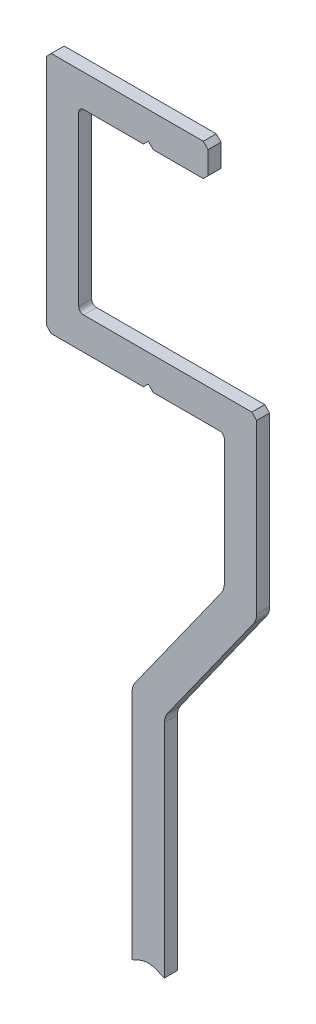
ISO-10303-21;
HEADER;
FILE_DESCRIPTION(('STEP AP214'),'2;1');
FILE_NAME('part.step','',(''),(''),'','','');
FILE_SCHEMA(('AUTOMOTIVE_DESIGN { 1 0 10303 214 1 1 1 1 }'));
ENDSEC;
DATA;
#1=APPLICATION_CONTEXT('core data for automotive mechanical design processes');
#2=APPLICATION_PROTOCOL_DEFINITION('international standard','automotive_design',2000,#1);
#3=PRODUCT_CONTEXT('',#1,'mechanical');
#4=PRODUCT('Part','Part','',(#3));
#5=PRODUCT_RELATED_PRODUCT_CATEGORY('part','',(#4));
#6=PRODUCT_DEFINITION_FORMATION('','',#4);
#7=PRODUCT_DEFINITION_CONTEXT('part definition',#1,'design');
#8=PRODUCT_DEFINITION('design','',#6,#7);
#9=PRODUCT_DEFINITION_SHAPE('','',#8);
#10=(LENGTH_UNIT() NAMED_UNIT(*) SI_UNIT(.MILLI.,.METRE.));
#11=(NAMED_UNIT(*) PLANE_ANGLE_UNIT() SI_UNIT($,.RADIAN.));
#12=(NAMED_UNIT(*) SI_UNIT($,.STERADIAN.) SOLID_ANGLE_UNIT());
#13=UNCERTAINTY_MEASURE_WITH_UNIT(LENGTH_MEASURE(1.E-05),#10,'distance_accuracy_value','');
#14=(GEOMETRIC_REPRESENTATION_CONTEXT(3) GLOBAL_UNCERTAINTY_ASSIGNED_CONTEXT((#13)) GLOBAL_UNIT_ASSIGNED_CONTEXT((#10,
#11,#12)) REPRESENTATION_CONTEXT('',''));
#15=CARTESIAN_POINT('',(0.,0.,0.));
#16=DIRECTION('',(0.,0.,1.));
#17=DIRECTION('',(1.,0.,0.));
#18=AXIS2_PLACEMENT_3D('',#15,#16,#17);
#19=CARTESIAN_POINT('',(0.,0.,0.));
#20=DIRECTION('',(0.,-1.,0.));
#21=DIRECTION('',(0.,0.,-1.));
#22=AXIS2_PLACEMENT_3D('',#19,#20,#21);
#23=PLANE('',#22);
#24=DIRECTION('',(0.,0.,1.));
#25=VECTOR('',#24,1.);
#26=CARTESIAN_POINT('',(53.,0.,8.));
#27=LINE('',#26,#25);
#28=CARTESIAN_POINT('',(53.,0.,8.));
#29=VERTEX_POINT('',#28);
#30=CARTESIAN_POINT('',(53.,0.,0.));
#31=VERTEX_POINT('',#30);
#32=EDGE_CURVE('E287',#29,#31,#27,.F.);
#33=ORIENTED_EDGE('',*,*,#32,.T.);
#34=DIRECTION('',(1.,0.,0.));
#35=VECTOR('',#34,1.);
#36=CARTESIAN_POINT('',(65.,0.,0.));
#37=LINE('',#36,#35);
#38=CARTESIAN_POINT('',(53.6844486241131,0.,0.));
#39=VERTEX_POINT('',#38);
#40=EDGE_CURVE('E190',#31,#39,#37,.T.);
#41=ORIENTED_EDGE('',*,*,#40,.T.);
#42=DIRECTION('',(0.,0.,1.));
#43=VECTOR('',#42,1.);
#44=CARTESIAN_POINT('',(53.6844486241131,0.,8.));
#45=LINE('',#44,#43);
#46=CARTESIAN_POINT('',(53.6844486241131,0.,8.));
#47=VERTEX_POINT('',#46);
#48=EDGE_CURVE('E188',#39,#47,#45,.T.);
#49=ORIENTED_EDGE('',*,*,#48,.T.);
#50=DIRECTION('',(1.,0.,0.));
#51=VECTOR('',#50,1.);
#52=CARTESIAN_POINT('',(0.,0.,8.));
#53=LINE('',#52,#51);
#54=EDGE_CURVE('E173',#47,#29,#53,.F.);
#55=ORIENTED_EDGE('',*,*,#54,.T.);
#56=EDGE_LOOP('',(#33,#41,#49,#55));
#57=FACE_BOUND('',#56,.T.);
#58=ADVANCED_FACE('F17',(#57),#23,.T.);
#59=CARTESIAN_POINT('',(0.,0.,0.));
#60=DIRECTION('',(0.,-1.,0.));
#61=DIRECTION('',(0.,0.,-1.));
#62=AXIS2_PLACEMENT_3D('',#59,#60,#61);
#63=PLANE('',#62);
#64=DIRECTION('',(0.,0.,1.));
#65=VECTOR('',#64,1.);
#66=CARTESIAN_POINT('',(73.,0.,8.));
#67=LINE('',#66,#65);
#68=CARTESIAN_POINT('',(73.,0.,0.));
#69=VERTEX_POINT('',#68);
#70=CARTESIAN_POINT('',(73.,0.,8.));
#71=VERTEX_POINT('',#70);
#72=EDGE_CURVE('E267',#69,#71,#67,.T.);
#73=ORIENTED_EDGE('',*,*,#72,.T.);
#74=DIRECTION('',(1.,0.,0.));
#75=VECTOR('',#74,1.);
#76=CARTESIAN_POINT('',(0.,0.,8.));
#77=LINE('',#76,#75);
#78=CARTESIAN_POINT('',(72.3155513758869,0.,8.));
#79=VERTEX_POINT('',#78);
#80=EDGE_CURVE('E185',#71,#79,#77,.F.);
#81=ORIENTED_EDGE('',*,*,#80,.T.);
#82=DIRECTION('',(0.,0.,1.));
#83=VECTOR('',#82,1.);
#84=CARTESIAN_POINT('',(72.3155513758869,0.,8.));
#85=LINE('',#84,#83);
#86=CARTESIAN_POINT('',(72.3155513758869,0.,0.));
#87=VERTEX_POINT('',#86);
#88=EDGE_CURVE('E275',#79,#87,#85,.F.);
#89=ORIENTED_EDGE('',*,*,#88,.T.);
#90=DIRECTION('',(1.,0.,0.));
#91=VECTOR('',#90,1.);
#92=CARTESIAN_POINT('',(65.,0.,0.));
#93=LINE('',#92,#91);
#94=EDGE_CURVE('E475',#87,#69,#93,.T.);
#95=ORIENTED_EDGE('',*,*,#94,.T.);
#96=EDGE_LOOP('',(#73,#81,#89,#95));
#97=FACE_BOUND('',#96,.T.);
#98=ADVANCED_FACE('F1085',(#97),#63,.T.);
#99=CARTESIAN_POINT('',(65.,230.,0.));
#100=DIRECTION('',(0.,0.,1.));
#101=DIRECTION('',(1.,0.,0.));
#102=AXIS2_PLACEMENT_3D('',#99,#100,#101);
#103=PLANE('',#102);
#104=DIRECTION('',(0.,1.,0.));
#105=VECTOR('',#104,1.);
#106=CARTESIAN_POINT('',(130.,0.,0.));
#107=LINE('',#106,#105);
#108=CARTESIAN_POINT('',(130.,223.198126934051,0.));
#109=VERTEX_POINT('',#108);
#110=CARTESIAN_POINT('',(130.,327.,0.));
#111=VERTEX_POINT('',#110);
#112=EDGE_CURVE('E247',#109,#111,#107,.T.);
#113=ORIENTED_EDGE('',*,*,#112,.F.);
#114=CARTESIAN_POINT('',(120.,223.198126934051,0.));
#115=DIRECTION('',(0.,0.,-1.));
#116=DIRECTION('',(-1.,0.,0.));
#117=AXIS2_PLACEMENT_3D('',#114,#115,#116);
#118=CIRCLE('',#117,10.);
#119=CARTESIAN_POINT('',(128.144207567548,217.395379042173,0.));
#120=VERTEX_POINT('',#119);
#121=EDGE_CURVE('E260',#120,#109,#118,.F.);
#122=ORIENTED_EDGE('',*,*,#121,.F.);
#123=DIRECTION('',(-0.580274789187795,-0.8144207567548,0.));
#124=VECTOR('',#123,1.);
#125=CARTESIAN_POINT('',(73.,140.,0.));
#126=LINE('',#125,#124);
#127=CARTESIAN_POINT('',(74.8557924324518,142.604620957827,0.));
#128=VERTEX_POINT('',#127);
#129=EDGE_CURVE('E263',#120,#128,#126,.T.);
#130=ORIENTED_EDGE('',*,*,#129,.T.);
#131=CARTESIAN_POINT('',(83.,136.801873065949,0.));
#132=DIRECTION('',(0.,0.,-1.));
#133=DIRECTION('',(-1.,0.,0.));
#134=AXIS2_PLACEMENT_3D('',#131,#132,#133);
#135=CIRCLE('',#134,10.);
#136=CARTESIAN_POINT('',(73.,136.801873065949,0.));
#137=VERTEX_POINT('',#136);
#138=EDGE_CURVE('E266',#128,#137,#135,.F.);
#139=ORIENTED_EDGE('',*,*,#138,.T.);
#140=DIRECTION('',(0.,-1.,0.));
#141=VECTOR('',#140,1.);
#142=CARTESIAN_POINT('',(73.,0.,0.));
#143=LINE('',#142,#141);
#144=EDGE_CURVE('E270',#137,#69,#143,.T.);
#145=ORIENTED_EDGE('',*,*,#144,.T.);
#146=ORIENTED_EDGE('',*,*,#94,.F.);
#147=DIRECTION('',(-0.90630778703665,0.4226182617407,0.));
#148=VECTOR('',#147,1.);
#149=CARTESIAN_POINT('',(68.4940374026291,1.78200123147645,0.));
#150=LINE('',#149,#148);
#151=CARTESIAN_POINT('',(68.4940374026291,1.78200123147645,0.));
#152=VERTEX_POINT('',#151);
#153=EDGE_CURVE('E276',#87,#152,#150,.T.);
#154=ORIENTED_EDGE('',*,*,#153,.T.);
#155=CARTESIAN_POINT('',(63.,-10.,0.));
#156=DIRECTION('',(0.,0.,-1.));
#157=DIRECTION('',(-1.,0.,0.));
#158=AXIS2_PLACEMENT_3D('',#155,#156,#157);
#159=CIRCLE('',#158,13.);
#160=CARTESIAN_POINT('',(57.5059625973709,1.78200123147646,0.));
#161=VERTEX_POINT('',#160);
#162=EDGE_CURVE('E194',#152,#161,#159,.F.);
#163=ORIENTED_EDGE('',*,*,#162,.T.);
#164=DIRECTION('',(-0.90630778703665,-0.4226182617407,0.));
#165=VECTOR('',#164,1.);
#166=CARTESIAN_POINT('',(23.0475966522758,-14.2861986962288,0.));
#167=LINE('',#166,#165);
#168=EDGE_CURVE('E195',#161,#39,#167,.T.);
#169=ORIENTED_EDGE('',*,*,#168,.T.);
#170=ORIENTED_EDGE('',*,*,#40,.F.);
#171=DIRECTION('',(0.,1.,0.));
#172=VECTOR('',#171,1.);
#173=CARTESIAN_POINT('',(53.,146.4,0.));
#174=LINE('',#173,#172);
#175=CARTESIAN_POINT('',(53.,143.201873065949,0.));
#176=VERTEX_POINT('',#175);
#177=EDGE_CURVE('E286',#31,#176,#174,.T.);
#178=ORIENTED_EDGE('',*,*,#177,.T.);
#179=CARTESIAN_POINT('',(63.,143.201873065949,0.));
#180=DIRECTION('',(0.,0.,-1.));
#181=DIRECTION('',(-1.,0.,0.));
#182=AXIS2_PLACEMENT_3D('',#179,#180,#181);
#183=CIRCLE('',#182,10.);
#184=CARTESIAN_POINT('',(54.8557924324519,149.004620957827,0.));
#185=VERTEX_POINT('',#184);
#186=EDGE_CURVE('E294',#185,#176,#183,.F.);
#187=ORIENTED_EDGE('',*,*,#186,.F.);
#188=DIRECTION('',(0.580274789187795,0.8144207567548,0.));
#189=VECTOR('',#188,1.);
#190=CARTESIAN_POINT('',(110.,226.4,0.));
#191=LINE('',#190,#189);
#192=CARTESIAN_POINT('',(108.144207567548,223.795379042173,0.));
#193=VERTEX_POINT('',#192);
#194=EDGE_CURVE('E297',#185,#193,#191,.T.);
#195=ORIENTED_EDGE('',*,*,#194,.T.);
#196=CARTESIAN_POINT('',(100.,229.598126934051,0.));
#197=DIRECTION('',(0.,0.,-1.));
#198=DIRECTION('',(-1.,0.,0.));
#199=AXIS2_PLACEMENT_3D('',#196,#197,#198);
#200=CIRCLE('',#199,10.);
#201=CARTESIAN_POINT('',(110.,229.598126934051,0.));
#202=VERTEX_POINT('',#201);
#203=EDGE_CURVE('E300',#193,#202,#200,.F.);
#204=ORIENTED_EDGE('',*,*,#203,.T.);
#205=DIRECTION('',(0.,1.,0.));
#206=VECTOR('',#205,1.);
#207=CARTESIAN_POINT('',(110.,310.,0.));
#208=LINE('',#207,#206);
#209=CARTESIAN_POINT('',(110.,307.,0.));
#210=VERTEX_POINT('',#209);
#211=EDGE_CURVE('E303',#202,#210,#208,.T.);
#212=ORIENTED_EDGE('',*,*,#211,.T.);
#213=CARTESIAN_POINT('',(107.,307.,0.));
#214=DIRECTION('',(0.,0.,-1.));
#215=DIRECTION('',(-1.,0.,0.));
#216=AXIS2_PLACEMENT_3D('',#213,#214,#215);
#217=CIRCLE('',#216,3.);
#218=CARTESIAN_POINT('',(107.,310.,0.));
#219=VERTEX_POINT('',#218);
#220=EDGE_CURVE('E306',#210,#219,#217,.F.);
#221=ORIENTED_EDGE('',*,*,#220,.T.);
#222=DIRECTION('',(1.,0.,0.));
#223=VECTOR('',#222,1.);
#224=CARTESIAN_POINT('',(0.,310.,0.));
#225=LINE('',#224,#223);
#226=CARTESIAN_POINT('',(66.,310.,0.));
#227=VERTEX_POINT('',#226);
#228=EDGE_CURVE('E310',#219,#227,#225,.F.);
#229=ORIENTED_EDGE('',*,*,#228,.T.);
#230=DIRECTION('',(-0.707106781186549,0.707106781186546,0.));
#231=VECTOR('',#230,1.);
#232=CARTESIAN_POINT('',(63.,313.,0.));
#233=LINE('',#232,#231);
#234=CARTESIAN_POINT('',(62.9999999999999,313.,0.));
#235=VERTEX_POINT('',#234);
#236=EDGE_CURVE('E321',#227,#235,#233,.T.);
#237=ORIENTED_EDGE('',*,*,#236,.T.);
#238=DIRECTION('',(-0.70710678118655,-0.707106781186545,0.));
#239=VECTOR('',#238,1.);
#240=CARTESIAN_POINT('',(55.9289321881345,305.928932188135,0.));
#241=LINE('',#240,#239);
#242=CARTESIAN_POINT('',(59.9999999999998,310.,0.));
#243=VERTEX_POINT('',#242);
#244=EDGE_CURVE('E332',#235,#243,#241,.T.);
#245=ORIENTED_EDGE('',*,*,#244,.T.);
#246=DIRECTION('',(1.,0.,0.));
#247=VECTOR('',#246,1.);
#248=CARTESIAN_POINT('',(0.,310.,0.));
#249=LINE('',#248,#247);
#250=CARTESIAN_POINT('',(3.,310.,0.));
#251=VERTEX_POINT('',#250);
#252=EDGE_CURVE('E343',#243,#251,#249,.F.);
#253=ORIENTED_EDGE('',*,*,#252,.T.);
#254=DIRECTION('',(0.707106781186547,-0.707106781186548,0.));
#255=VECTOR('',#254,1.);
#256=CARTESIAN_POINT('',(1.5,311.5,0.));
#257=LINE('',#256,#255);
#258=CARTESIAN_POINT('',(0.,313.,0.));
#259=VERTEX_POINT('',#258);
#260=EDGE_CURVE('E354',#259,#251,#257,.T.);
#261=ORIENTED_EDGE('',*,*,#260,.F.);
#262=DIRECTION('',(0.,1.,0.));
#263=VECTOR('',#262,1.);
#264=CARTESIAN_POINT('',(0.,460.,0.));
#265=LINE('',#264,#263);
#266=CARTESIAN_POINT('',(0.,457.,0.));
#267=VERTEX_POINT('',#266);
#268=EDGE_CURVE('E355',#267,#259,#265,.F.);
#269=ORIENTED_EDGE('',*,*,#268,.F.);
#270=DIRECTION('',(-0.707106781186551,-0.707106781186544,0.));
#271=VECTOR('',#270,1.);
#272=CARTESIAN_POINT('',(1.5,458.5,0.));
#273=LINE('',#272,#271);
#274=CARTESIAN_POINT('',(3.00000000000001,460.,0.));
#275=VERTEX_POINT('',#274);
#276=EDGE_CURVE('E366',#275,#267,#273,.T.);
#277=ORIENTED_EDGE('',*,*,#276,.F.);
#278=DIRECTION('',(1.,0.,0.));
#279=VECTOR('',#278,1.);
#280=CARTESIAN_POINT('',(130.,460.,0.));
#281=LINE('',#280,#279);
#282=CARTESIAN_POINT('',(97.,460.,0.));
#283=VERTEX_POINT('',#282);
#284=EDGE_CURVE('E377',#283,#275,#281,.F.);
#285=ORIENTED_EDGE('',*,*,#284,.F.);
#286=DIRECTION('',(-0.707106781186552,0.707106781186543,0.));
#287=VECTOR('',#286,1.);
#288=CARTESIAN_POINT('',(98.5,458.5,0.));
#289=LINE('',#288,#287);
#290=CARTESIAN_POINT('',(100.,457.,0.));
#291=VERTEX_POINT('',#290);
#292=EDGE_CURVE('E398',#291,#283,#289,.T.);
#293=ORIENTED_EDGE('',*,*,#292,.F.);
#294=DIRECTION('',(0.,1.,0.));
#295=VECTOR('',#294,1.);
#296=CARTESIAN_POINT('',(100.,440.,0.));
#297=LINE('',#296,#295);
#298=CARTESIAN_POINT('',(100.,443.,0.));
#299=VERTEX_POINT('',#298);
#300=EDGE_CURVE('E409',#291,#299,#297,.F.);
#301=ORIENTED_EDGE('',*,*,#300,.T.);
#302=DIRECTION('',(0.707106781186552,0.707106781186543,0.));
#303=VECTOR('',#302,1.);
#304=CARTESIAN_POINT('',(98.5,441.5,0.));
#305=LINE('',#304,#303);
#306=CARTESIAN_POINT('',(97.,440.,0.));
#307=VERTEX_POINT('',#306);
#308=EDGE_CURVE('E420',#307,#299,#305,.T.);
#309=ORIENTED_EDGE('',*,*,#308,.F.);
#310=DIRECTION('',(1.,0.,0.));
#311=VECTOR('',#310,1.);
#312=CARTESIAN_POINT('',(20.,440.,0.));
#313=LINE('',#312,#311);
#314=CARTESIAN_POINT('',(66.,440.,0.));
#315=VERTEX_POINT('',#314);
#316=EDGE_CURVE('E431',#307,#315,#313,.F.);
#317=ORIENTED_EDGE('',*,*,#316,.T.);
#318=DIRECTION('',(-0.707106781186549,0.707106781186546,0.));
#319=VECTOR('',#318,1.);
#320=CARTESIAN_POINT('',(63.0000000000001,443.,0.));
#321=LINE('',#320,#319);
#322=CARTESIAN_POINT('',(63.,443.,0.));
#323=VERTEX_POINT('',#322);
#324=EDGE_CURVE('E441',#315,#323,#321,.T.);
#325=ORIENTED_EDGE('',*,*,#324,.T.);
#326=DIRECTION('',(-0.70710678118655,-0.707106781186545,0.));
#327=VECTOR('',#326,1.);
#328=CARTESIAN_POINT('',(55.9289321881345,435.928932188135,0.));
#329=LINE('',#328,#327);
#330=CARTESIAN_POINT('',(59.9999999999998,440.,0.));
#331=VERTEX_POINT('',#330);
#332=EDGE_CURVE('E451',#323,#331,#329,.T.);
#333=ORIENTED_EDGE('',*,*,#332,.T.);
#334=DIRECTION('',(1.,0.,0.));
#335=VECTOR('',#334,1.);
#336=CARTESIAN_POINT('',(20.,440.,0.));
#337=LINE('',#336,#335);
#338=CARTESIAN_POINT('',(23.,440.,0.));
#339=VERTEX_POINT('',#338);
#340=EDGE_CURVE('E456',#331,#339,#337,.F.);
#341=ORIENTED_EDGE('',*,*,#340,.T.);
#342=CARTESIAN_POINT('',(23.,437.,0.));
#343=DIRECTION('',(0.,0.,-1.));
#344=DIRECTION('',(-1.,0.,0.));
#345=AXIS2_PLACEMENT_3D('',#342,#343,#344);
#346=CIRCLE('',#345,3.);
#347=CARTESIAN_POINT('',(20.,437.,0.));
#348=VERTEX_POINT('',#347);
#349=EDGE_CURVE('E459',#339,#348,#346,.F.);
#350=ORIENTED_EDGE('',*,*,#349,.T.);
#351=DIRECTION('',(0.,-1.,0.));
#352=VECTOR('',#351,1.);
#353=CARTESIAN_POINT('',(20.,330.,0.));
#354=LINE('',#353,#352);
#355=CARTESIAN_POINT('',(20.,333.,0.));
#356=VERTEX_POINT('',#355);
#357=EDGE_CURVE('E143',#348,#356,#354,.T.);
#358=ORIENTED_EDGE('',*,*,#357,.T.);
#359=CARTESIAN_POINT('',(23.,333.,0.));
#360=DIRECTION('',(0.,0.,-1.));
#361=DIRECTION('',(-1.,0.,0.));
#362=AXIS2_PLACEMENT_3D('',#359,#360,#361);
#363=CIRCLE('',#362,3.);
#364=CARTESIAN_POINT('',(23.,330.,0.));
#365=VERTEX_POINT('',#364);
#366=EDGE_CURVE('E20',#356,#365,#363,.F.);
#367=ORIENTED_EDGE('',*,*,#366,.T.);
#368=DIRECTION('',(1.,0.,0.));
#369=VECTOR('',#368,1.);
#370=CARTESIAN_POINT('',(130.,330.,0.));
#371=LINE('',#370,#369);
#372=CARTESIAN_POINT('',(127.,330.,0.));
#373=VERTEX_POINT('',#372);
#374=EDGE_CURVE('E150',#365,#373,#371,.T.);
#375=ORIENTED_EDGE('',*,*,#374,.T.);
#376=DIRECTION('',(-0.707106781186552,0.707106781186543,0.));
#377=VECTOR('',#376,1.);
#378=CARTESIAN_POINT('',(128.5,328.5,0.));
#379=LINE('',#378,#377);
#380=EDGE_CURVE('E473',#111,#373,#379,.T.);
#381=ORIENTED_EDGE('',*,*,#380,.F.);
#382=EDGE_LOOP('',(#113,#122,#130,#139,#145,#146,#154,#163,#169,#170,#178,#187,#195,#204,#212,
#221,#229,#237,#245,#253,#261,#269,#277,#285,#293,#301,#309,#317,#325,#333,#341,#350,#358,#367,
#375,#381));
#383=FACE_BOUND('',#382,.T.);
#384=ADVANCED_FACE('F591',(#383),#103,.F.);
#385=CARTESIAN_POINT('',(128.5,328.5,4.));
#386=DIRECTION('',(0.707106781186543,0.707106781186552,0.));
#387=DIRECTION('',(-0.707106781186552,0.707106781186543,0.));
#388=AXIS2_PLACEMENT_3D('',#385,#386,#387);
#389=PLANE('',#388);
#390=ORIENTED_EDGE('',*,*,#380,.T.);
#391=DIRECTION('',(0.,0.,-1.));
#392=VECTOR('',#391,1.);
#393=CARTESIAN_POINT('',(127.,330.,8.));
#394=LINE('',#393,#392);
#395=CARTESIAN_POINT('',(127.,330.,8.));
#396=VERTEX_POINT('',#395);
#397=EDGE_CURVE('E464',#373,#396,#394,.F.);
#398=ORIENTED_EDGE('',*,*,#397,.T.);
#399=DIRECTION('',(-0.707106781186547,0.707106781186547,0.));
#400=VECTOR('',#399,1.);
#401=CARTESIAN_POINT('',(130.,327.,8.));
#402=LINE('',#401,#400);
#403=CARTESIAN_POINT('',(130.,327.,8.));
#404=VERTEX_POINT('',#403);
#405=EDGE_CURVE('E243',#404,#396,#402,.T.);
#406=ORIENTED_EDGE('',*,*,#405,.F.);
#407=DIRECTION('',(0.,0.,-1.));
#408=VECTOR('',#407,1.);
#409=CARTESIAN_POINT('',(130.,327.,0.));
#410=LINE('',#409,#408);
#411=EDGE_CURVE('E248',#111,#404,#410,.F.);
#412=ORIENTED_EDGE('',*,*,#411,.F.);
#413=EDGE_LOOP('',(#390,#398,#406,#412));
#414=FACE_BOUND('',#413,.T.);
#415=ADVANCED_FACE('F613',(#414),#389,.T.);
#416=CARTESIAN_POINT('',(130.,330.,8.));
#417=DIRECTION('',(0.,-1.,0.));
#418=DIRECTION('',(0.,0.,-1.));
#419=AXIS2_PLACEMENT_3D('',#416,#417,#418);
#420=PLANE('',#419);
#421=ORIENTED_EDGE('',*,*,#374,.F.);
#422=DIRECTION('',(0.,0.,-1.));
#423=VECTOR('',#422,1.);
#424=CARTESIAN_POINT('',(23.,330.,8.));
#425=LINE('',#424,#423);
#426=CARTESIAN_POINT('',(23.,330.,8.));
#427=VERTEX_POINT('',#426);
#428=EDGE_CURVE('E462',#365,#427,#425,.F.);
#429=ORIENTED_EDGE('',*,*,#428,.T.);
#430=DIRECTION('',(1.,0.,0.));
#431=VECTOR('',#430,1.);
#432=CARTESIAN_POINT('',(65.,330.,8.));
#433=LINE('',#432,#431);
#434=EDGE_CURVE('E240',#396,#427,#433,.F.);
#435=ORIENTED_EDGE('',*,*,#434,.F.);
#436=ORIENTED_EDGE('',*,*,#397,.F.);
#437=EDGE_LOOP('',(#421,#429,#435,#436));
#438=FACE_BOUND('',#437,.T.);
#439=ADVANCED_FACE('F609',(#438),#420,.F.);
#440=CARTESIAN_POINT('',(23.,333.,8.));
#441=DIRECTION('',(0.,0.,-1.));
#442=DIRECTION('',(-1.,0.,0.));
#443=AXIS2_PLACEMENT_3D('',#440,#441,#442);
#444=CYLINDRICAL_SURFACE('',#443,3.);
#445=ORIENTED_EDGE('',*,*,#428,.F.);
#446=ORIENTED_EDGE('',*,*,#366,.F.);
#447=DIRECTION('',(0.,0.,1.));
#448=VECTOR('',#447,1.);
#449=CARTESIAN_POINT('',(20.,333.,8.));
#450=LINE('',#449,#448);
#451=CARTESIAN_POINT('',(20.,333.,8.));
#452=VERTEX_POINT('',#451);
#453=EDGE_CURVE('E460',#356,#452,#450,.T.);
#454=ORIENTED_EDGE('',*,*,#453,.T.);
#455=CARTESIAN_POINT('',(23.,333.,8.));
#456=DIRECTION('',(0.,0.,-1.));
#457=DIRECTION('',(-1.,0.,0.));
#458=AXIS2_PLACEMENT_3D('',#455,#456,#457);
#459=CIRCLE('',#458,3.);
#460=EDGE_CURVE('E239',#427,#452,#459,.T.);
#461=ORIENTED_EDGE('',*,*,#460,.F.);
#462=EDGE_LOOP('',(#445,#446,#454,#461));
#463=FACE_BOUND('',#462,.T.);
#464=ADVANCED_FACE('F607',(#463),#444,.F.);
#465=CARTESIAN_POINT('',(20.,330.,8.));
#466=DIRECTION('',(-1.,0.,0.));
#467=DIRECTION('',(0.,-1.,0.));
#468=AXIS2_PLACEMENT_3D('',#465,#466,#467);
#469=PLANE('',#468);
#470=ORIENTED_EDGE('',*,*,#357,.F.);
#471=DIRECTION('',(0.,0.,-1.));
#472=VECTOR('',#471,1.);
#473=CARTESIAN_POINT('',(20.,437.,8.));
#474=LINE('',#473,#472);
#475=CARTESIAN_POINT('',(20.,437.,8.));
#476=VERTEX_POINT('',#475);
#477=EDGE_CURVE('E457',#348,#476,#474,.F.);
#478=ORIENTED_EDGE('',*,*,#477,.T.);
#479=DIRECTION('',(0.,1.,0.));
#480=VECTOR('',#479,1.);
#481=CARTESIAN_POINT('',(20.,230.,8.));
#482=LINE('',#481,#480);
#483=EDGE_CURVE('E236',#452,#476,#482,.T.);
#484=ORIENTED_EDGE('',*,*,#483,.F.);
#485=ORIENTED_EDGE('',*,*,#453,.F.);
#486=EDGE_LOOP('',(#470,#478,#484,#485));
#487=FACE_BOUND('',#486,.T.);
#488=ADVANCED_FACE('F598',(#487),#469,.F.);
#489=CARTESIAN_POINT('',(23.,437.,8.));
#490=DIRECTION('',(0.,0.,-1.));
#491=DIRECTION('',(-1.,0.,0.));
#492=AXIS2_PLACEMENT_3D('',#489,#490,#491);
#493=CYLINDRICAL_SURFACE('',#492,3.);
#494=ORIENTED_EDGE('',*,*,#477,.F.);
#495=ORIENTED_EDGE('',*,*,#349,.F.);
#496=DIRECTION('',(0.,0.,1.));
#497=VECTOR('',#496,1.);
#498=CARTESIAN_POINT('',(23.,440.,8.));
#499=LINE('',#498,#497);
#500=CARTESIAN_POINT('',(23.,440.,8.));
#501=VERTEX_POINT('',#500);
#502=EDGE_CURVE('E454',#339,#501,#499,.T.);
#503=ORIENTED_EDGE('',*,*,#502,.T.);
#504=CARTESIAN_POINT('',(23.,437.,8.));
#505=DIRECTION('',(0.,0.,-1.));
#506=DIRECTION('',(-1.,0.,0.));
#507=AXIS2_PLACEMENT_3D('',#504,#505,#506);
#508=CIRCLE('',#507,3.);
#509=EDGE_CURVE('E233',#476,#501,#508,.T.);
#510=ORIENTED_EDGE('',*,*,#509,.F.);
#511=EDGE_LOOP('',(#494,#495,#503,#510));
#512=FACE_BOUND('',#511,.T.);
#513=ADVANCED_FACE('F601',(#512),#493,.F.);
#514=CARTESIAN_POINT('',(20.,440.,8.));
#515=DIRECTION('',(0.,1.,0.));
#516=DIRECTION('',(0.,0.,1.));
#517=AXIS2_PLACEMENT_3D('',#514,#515,#516);
#518=PLANE('',#517);
#519=ORIENTED_EDGE('',*,*,#340,.F.);
#520=DIRECTION('',(0.,0.,1.));
#521=VECTOR('',#520,1.);
#522=CARTESIAN_POINT('',(59.9999999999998,440.,8.));
#523=LINE('',#522,#521);
#524=CARTESIAN_POINT('',(60.,440.,8.));
#525=VERTEX_POINT('',#524);
#526=EDGE_CURVE('E448',#331,#525,#523,.T.);
#527=ORIENTED_EDGE('',*,*,#526,.T.);
#528=DIRECTION('',(1.,0.,0.));
#529=VECTOR('',#528,1.);
#530=CARTESIAN_POINT('',(65.,440.,8.));
#531=LINE('',#530,#529);
#532=EDGE_CURVE('E229',#501,#525,#531,.T.);
#533=ORIENTED_EDGE('',*,*,#532,.F.);
#534=ORIENTED_EDGE('',*,*,#502,.F.);
#535=EDGE_LOOP('',(#519,#527,#533,#534));
#536=FACE_BOUND('',#535,.T.);
#537=ADVANCED_FACE('F681',(#536),#518,.F.);
#538=CARTESIAN_POINT('',(55.9289321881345,435.928932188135,8.));
#539=DIRECTION('',(-0.707106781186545,0.70710678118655,0.));
#540=DIRECTION('',(-0.70710678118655,-0.707106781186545,0.));
#541=AXIS2_PLACEMENT_3D('',#538,#539,#540);
#542=PLANE('',#541);
#543=ORIENTED_EDGE('',*,*,#332,.F.);
#544=DIRECTION('',(0.,0.,1.));
#545=VECTOR('',#544,1.);
#546=CARTESIAN_POINT('',(63.0000000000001,443.,8.));
#547=LINE('',#546,#545);
#548=CARTESIAN_POINT('',(63.0000000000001,443.,8.));
#549=VERTEX_POINT('',#548);
#550=EDGE_CURVE('E438',#323,#549,#547,.T.);
#551=ORIENTED_EDGE('',*,*,#550,.T.);
#552=DIRECTION('',(0.707106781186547,0.707106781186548,0.));
#553=VECTOR('',#552,1.);
#554=CARTESIAN_POINT('',(60.0000000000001,440.,8.));
#555=LINE('',#554,#553);
#556=EDGE_CURVE('E232',#525,#549,#555,.T.);
#557=ORIENTED_EDGE('',*,*,#556,.F.);
#558=ORIENTED_EDGE('',*,*,#526,.F.);
#559=EDGE_LOOP('',(#543,#551,#557,#558));
#560=FACE_BOUND('',#559,.T.);
#561=ADVANCED_FACE('F683',(#560),#542,.F.);
#562=CARTESIAN_POINT('',(63.0000000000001,443.,8.));
#563=DIRECTION('',(0.707106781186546,0.707106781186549,0.));
#564=DIRECTION('',(-0.707106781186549,0.707106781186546,0.));
#565=AXIS2_PLACEMENT_3D('',#562,#563,#564);
#566=PLANE('',#565);
#567=DIRECTION('',(0.707106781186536,-0.707106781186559,0.));
#568=VECTOR('',#567,1.);
#569=CARTESIAN_POINT('',(63.0000000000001,443.,8.));
#570=LINE('',#569,#568);
#571=CARTESIAN_POINT('',(66.,440.,8.));
#572=VERTEX_POINT('',#571);
#573=EDGE_CURVE('E426',#549,#572,#570,.T.);
#574=ORIENTED_EDGE('',*,*,#573,.F.);
#575=ORIENTED_EDGE('',*,*,#550,.F.);
#576=ORIENTED_EDGE('',*,*,#324,.F.);
#577=DIRECTION('',(0.,0.,1.));
#578=VECTOR('',#577,1.);
#579=CARTESIAN_POINT('',(66.,440.,8.));
#580=LINE('',#579,#578);
#581=EDGE_CURVE('E421',#315,#572,#580,.T.);
#582=ORIENTED_EDGE('',*,*,#581,.T.);
#583=EDGE_LOOP('',(#574,#575,#576,#582));
#584=FACE_BOUND('',#583,.T.);
#585=ADVANCED_FACE('F687',(#584),#566,.F.);
#586=CARTESIAN_POINT('',(20.,440.,8.));
#587=DIRECTION('',(0.,1.,0.));
#588=DIRECTION('',(0.,0.,1.));
#589=AXIS2_PLACEMENT_3D('',#586,#587,#588);
#590=PLANE('',#589);
#591=DIRECTION('',(1.,0.,0.));
#592=VECTOR('',#591,1.);
#593=CARTESIAN_POINT('',(65.,440.,8.));
#594=LINE('',#593,#592);
#595=CARTESIAN_POINT('',(97.,440.,8.));
#596=VERTEX_POINT('',#595);
#597=EDGE_CURVE('E414',#572,#596,#594,.T.);
#598=ORIENTED_EDGE('',*,*,#597,.F.);
#599=ORIENTED_EDGE('',*,*,#581,.F.);
#600=ORIENTED_EDGE('',*,*,#316,.F.);
#601=DIRECTION('',(0.,0.,1.));
#602=VECTOR('',#601,1.);
#603=CARTESIAN_POINT('',(97.,440.,8.));
#604=LINE('',#603,#602);
#605=EDGE_CURVE('E417',#596,#307,#604,.F.);
#606=ORIENTED_EDGE('',*,*,#605,.F.);
#607=EDGE_LOOP('',(#598,#599,#600,#606));
#608=FACE_BOUND('',#607,.T.);
#609=ADVANCED_FACE('F690',(#608),#590,.F.);
#610=CARTESIAN_POINT('',(98.5,441.5,8.));
#611=DIRECTION('',(0.707106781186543,-0.707106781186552,0.));
#612=DIRECTION('',(0.707106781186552,0.707106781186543,0.));
#613=AXIS2_PLACEMENT_3D('',#610,#611,#612);
#614=PLANE('',#613);
#615=ORIENTED_EDGE('',*,*,#308,.T.);
#616=DIRECTION('',(0.,0.,1.));
#617=VECTOR('',#616,1.);
#618=CARTESIAN_POINT('',(100.,443.,8.));
#619=LINE('',#618,#617);
#620=CARTESIAN_POINT('',(100.,443.,8.));
#621=VERTEX_POINT('',#620);
#622=EDGE_CURVE('E406',#299,#621,#619,.T.);
#623=ORIENTED_EDGE('',*,*,#622,.T.);
#624=DIRECTION('',(0.707106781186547,0.707106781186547,0.));
#625=VECTOR('',#624,1.);
#626=CARTESIAN_POINT('',(97.,440.,8.));
#627=LINE('',#626,#625);
#628=EDGE_CURVE('E403',#596,#621,#627,.T.);
#629=ORIENTED_EDGE('',*,*,#628,.F.);
#630=ORIENTED_EDGE('',*,*,#605,.T.);
#631=EDGE_LOOP('',(#615,#623,#629,#630));
#632=FACE_BOUND('',#631,.T.);
#633=ADVANCED_FACE('F694',(#632),#614,.T.);
#634=CARTESIAN_POINT('',(100.,440.,8.));
#635=DIRECTION('',(-1.,0.,0.));
#636=DIRECTION('',(0.,0.,1.));
#637=AXIS2_PLACEMENT_3D('',#634,#635,#636);
#638=PLANE('',#637);
#639=DIRECTION('',(0.,1.,0.));
#640=VECTOR('',#639,1.);
#641=CARTESIAN_POINT('',(100.,230.,8.));
#642=LINE('',#641,#640);
#643=CARTESIAN_POINT('',(100.,457.,8.));
#644=VERTEX_POINT('',#643);
#645=EDGE_CURVE('E393',#621,#644,#642,.T.);
#646=ORIENTED_EDGE('',*,*,#645,.F.);
#647=ORIENTED_EDGE('',*,*,#622,.F.);
#648=ORIENTED_EDGE('',*,*,#300,.F.);
#649=DIRECTION('',(0.,0.,1.));
#650=VECTOR('',#649,1.);
#651=CARTESIAN_POINT('',(100.,457.,4.));
#652=LINE('',#651,#650);
#653=EDGE_CURVE('E388',#644,#291,#652,.F.);
#654=ORIENTED_EDGE('',*,*,#653,.F.);
#655=EDGE_LOOP('',(#646,#647,#648,#654));
#656=FACE_BOUND('',#655,.T.);
#657=ADVANCED_FACE('F699',(#656),#638,.F.);
#658=CARTESIAN_POINT('',(98.5,458.5,4.));
#659=DIRECTION('',(0.707106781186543,0.707106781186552,0.));
#660=DIRECTION('',(-0.707106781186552,0.707106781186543,0.));
#661=AXIS2_PLACEMENT_3D('',#658,#659,#660);
#662=PLANE('',#661);
#663=DIRECTION('',(-0.707106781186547,0.707106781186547,0.));
#664=VECTOR('',#663,1.);
#665=CARTESIAN_POINT('',(100.,457.,8.));
#666=LINE('',#665,#664);
#667=CARTESIAN_POINT('',(97.,460.,8.));
#668=VERTEX_POINT('',#667);
#669=EDGE_CURVE('E382',#644,#668,#666,.T.);
#670=ORIENTED_EDGE('',*,*,#669,.F.);
#671=ORIENTED_EDGE('',*,*,#653,.T.);
#672=ORIENTED_EDGE('',*,*,#292,.T.);
#673=DIRECTION('',(0.,0.,1.));
#674=VECTOR('',#673,1.);
#675=CARTESIAN_POINT('',(97.,460.,0.));
#676=LINE('',#675,#674);
#677=EDGE_CURVE('E385',#668,#283,#676,.F.);
#678=ORIENTED_EDGE('',*,*,#677,.F.);
#679=EDGE_LOOP('',(#670,#671,#672,#678));
#680=FACE_BOUND('',#679,.T.);
#681=ADVANCED_FACE('F702',(#680),#662,.T.);
#682=CARTESIAN_POINT('',(130.,460.,0.));
#683=DIRECTION('',(0.,1.,0.));
#684=DIRECTION('',(0.,0.,1.));
#685=AXIS2_PLACEMENT_3D('',#682,#683,#684);
#686=PLANE('',#685);
#687=ORIENTED_EDGE('',*,*,#677,.T.);
#688=ORIENTED_EDGE('',*,*,#284,.T.);
#689=DIRECTION('',(0.,0.,1.));
#690=VECTOR('',#689,1.);
#691=CARTESIAN_POINT('',(3.00000000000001,460.,0.));
#692=LINE('',#691,#690);
#693=CARTESIAN_POINT('',(3.00000000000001,460.,8.));
#694=VERTEX_POINT('',#693);
#695=EDGE_CURVE('E374',#694,#275,#692,.F.);
#696=ORIENTED_EDGE('',*,*,#695,.F.);
#697=DIRECTION('',(1.,0.,0.));
#698=VECTOR('',#697,1.);
#699=CARTESIAN_POINT('',(65.,460.,8.));
#700=LINE('',#699,#698);
#701=EDGE_CURVE('E371',#668,#694,#700,.F.);
#702=ORIENTED_EDGE('',*,*,#701,.F.);
#703=EDGE_LOOP('',(#687,#688,#696,#702));
#704=FACE_BOUND('',#703,.T.);
#705=ADVANCED_FACE('F706',(#704),#686,.T.);
#706=CARTESIAN_POINT('',(1.5,458.5,0.));
#707=DIRECTION('',(-0.707106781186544,0.707106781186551,0.));
#708=DIRECTION('',(-0.707106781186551,-0.707106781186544,0.));
#709=AXIS2_PLACEMENT_3D('',#706,#707,#708);
#710=PLANE('',#709);
#711=ORIENTED_EDGE('',*,*,#276,.T.);
#712=DIRECTION('',(0.,0.,1.));
#713=VECTOR('',#712,1.);
#714=CARTESIAN_POINT('',(0.,457.,0.));
#715=LINE('',#714,#713);
#716=CARTESIAN_POINT('',(0.,457.,8.));
#717=VERTEX_POINT('',#716);
#718=EDGE_CURVE('E363',#717,#267,#715,.F.);
#719=ORIENTED_EDGE('',*,*,#718,.F.);
#720=DIRECTION('',(-0.707106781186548,-0.707106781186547,0.));
#721=VECTOR('',#720,1.);
#722=CARTESIAN_POINT('',(3.00000000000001,460.,8.));
#723=LINE('',#722,#721);
#724=EDGE_CURVE('E360',#694,#717,#723,.T.);
#725=ORIENTED_EDGE('',*,*,#724,.F.);
#726=ORIENTED_EDGE('',*,*,#695,.T.);
#727=EDGE_LOOP('',(#711,#719,#725,#726));
#728=FACE_BOUND('',#727,.T.);
#729=ADVANCED_FACE('F710',(#728),#710,.T.);
#730=CARTESIAN_POINT('',(0.,460.,0.));
#731=DIRECTION('',(-1.,0.,0.));
#732=DIRECTION('',(0.,0.,1.));
#733=AXIS2_PLACEMENT_3D('',#730,#731,#732);
#734=PLANE('',#733);
#735=ORIENTED_EDGE('',*,*,#718,.T.);
#736=ORIENTED_EDGE('',*,*,#268,.T.);
#737=DIRECTION('',(0.,0.,1.));
#738=VECTOR('',#737,1.);
#739=CARTESIAN_POINT('',(0.,313.,4.));
#740=LINE('',#739,#738);
#741=CARTESIAN_POINT('',(0.,313.,8.));
#742=VERTEX_POINT('',#741);
#743=EDGE_CURVE('E351',#742,#259,#740,.F.);
#744=ORIENTED_EDGE('',*,*,#743,.F.);
#745=DIRECTION('',(0.,1.,0.));
#746=VECTOR('',#745,1.);
#747=CARTESIAN_POINT('',(0.,230.,8.));
#748=LINE('',#747,#746);
#749=EDGE_CURVE('E348',#717,#742,#748,.F.);
#750=ORIENTED_EDGE('',*,*,#749,.F.);
#751=EDGE_LOOP('',(#735,#736,#744,#750));
#752=FACE_BOUND('',#751,.T.);
#753=ADVANCED_FACE('F714',(#752),#734,.T.);
#754=CARTESIAN_POINT('',(1.5,311.5,4.));
#755=DIRECTION('',(-0.707106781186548,-0.707106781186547,0.));
#756=DIRECTION('',(0.707106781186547,-0.707106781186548,0.));
#757=AXIS2_PLACEMENT_3D('',#754,#755,#756);
#758=PLANE('',#757);
#759=ORIENTED_EDGE('',*,*,#260,.T.);
#760=DIRECTION('',(0.,0.,1.));
#761=VECTOR('',#760,1.);
#762=CARTESIAN_POINT('',(3.,310.,8.));
#763=LINE('',#762,#761);
#764=CARTESIAN_POINT('',(3.,310.,8.));
#765=VERTEX_POINT('',#764);
#766=EDGE_CURVE('E340',#251,#765,#763,.T.);
#767=ORIENTED_EDGE('',*,*,#766,.T.);
#768=DIRECTION('',(0.707106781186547,-0.707106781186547,0.));
#769=VECTOR('',#768,1.);
#770=CARTESIAN_POINT('',(0.,313.,8.));
#771=LINE('',#770,#769);
#772=EDGE_CURVE('E337',#742,#765,#771,.T.);
#773=ORIENTED_EDGE('',*,*,#772,.F.);
#774=ORIENTED_EDGE('',*,*,#743,.T.);
#775=EDGE_LOOP('',(#759,#767,#773,#774));
#776=FACE_BOUND('',#775,.T.);
#777=ADVANCED_FACE('F718',(#776),#758,.T.);
#778=CARTESIAN_POINT('',(0.,310.,8.));
#779=DIRECTION('',(0.,1.,0.));
#780=DIRECTION('',(0.,0.,1.));
#781=AXIS2_PLACEMENT_3D('',#778,#779,#780);
#782=PLANE('',#781);
#783=ORIENTED_EDGE('',*,*,#252,.F.);
#784=DIRECTION('',(0.,0.,1.));
#785=VECTOR('',#784,1.);
#786=CARTESIAN_POINT('',(59.9999999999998,310.,8.));
#787=LINE('',#786,#785);
#788=CARTESIAN_POINT('',(60.,310.,8.));
#789=VERTEX_POINT('',#788);
#790=EDGE_CURVE('E329',#243,#789,#787,.T.);
#791=ORIENTED_EDGE('',*,*,#790,.T.);
#792=DIRECTION('',(1.,0.,0.));
#793=VECTOR('',#792,1.);
#794=CARTESIAN_POINT('',(65.,310.,8.));
#795=LINE('',#794,#793);
#796=EDGE_CURVE('E326',#765,#789,#795,.T.);
#797=ORIENTED_EDGE('',*,*,#796,.F.);
#798=ORIENTED_EDGE('',*,*,#766,.F.);
#799=EDGE_LOOP('',(#783,#791,#797,#798));
#800=FACE_BOUND('',#799,.T.);
#801=ADVANCED_FACE('F724',(#800),#782,.F.);
#802=CARTESIAN_POINT('',(55.9289321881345,305.928932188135,8.));
#803=DIRECTION('',(-0.707106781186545,0.70710678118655,0.));
#804=DIRECTION('',(-0.70710678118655,-0.707106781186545,0.));
#805=AXIS2_PLACEMENT_3D('',#802,#803,#804);
#806=PLANE('',#805);
#807=ORIENTED_EDGE('',*,*,#244,.F.);
#808=DIRECTION('',(0.,0.,1.));
#809=VECTOR('',#808,1.);
#810=CARTESIAN_POINT('',(63.,313.,8.));
#811=LINE('',#810,#809);
#812=CARTESIAN_POINT('',(63.,313.,8.));
#813=VERTEX_POINT('',#812);
#814=EDGE_CURVE('E318',#235,#813,#811,.T.);
#815=ORIENTED_EDGE('',*,*,#814,.T.);
#816=DIRECTION('',(0.707106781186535,0.70710678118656,0.));
#817=VECTOR('',#816,1.);
#818=CARTESIAN_POINT('',(60.0000000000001,310.,8.));
#819=LINE('',#818,#817);
#820=EDGE_CURVE('E315',#789,#813,#819,.T.);
#821=ORIENTED_EDGE('',*,*,#820,.F.);
#822=ORIENTED_EDGE('',*,*,#790,.F.);
#823=EDGE_LOOP('',(#807,#815,#821,#822));
#824=FACE_BOUND('',#823,.T.);
#825=ADVANCED_FACE('F728',(#824),#806,.F.);
#826=CARTESIAN_POINT('',(63.,313.,8.));
#827=DIRECTION('',(0.707106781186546,0.707106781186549,0.));
#828=DIRECTION('',(-0.707106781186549,0.707106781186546,0.));
#829=AXIS2_PLACEMENT_3D('',#826,#827,#828);
#830=PLANE('',#829);
#831=DIRECTION('',(0.707106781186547,-0.707106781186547,0.));
#832=VECTOR('',#831,1.);
#833=CARTESIAN_POINT('',(63.,313.,8.));
#834=LINE('',#833,#832);
#835=CARTESIAN_POINT('',(66.,310.,8.));
#836=VERTEX_POINT('',#835);
#837=EDGE_CURVE('E226',#813,#836,#834,.T.);
#838=ORIENTED_EDGE('',*,*,#837,.F.);
#839=ORIENTED_EDGE('',*,*,#814,.F.);
#840=ORIENTED_EDGE('',*,*,#236,.F.);
#841=DIRECTION('',(0.,0.,1.));
#842=VECTOR('',#841,1.);
#843=CARTESIAN_POINT('',(66.,310.,8.));
#844=LINE('',#843,#842);
#845=EDGE_CURVE('E307',#227,#836,#844,.T.);
#846=ORIENTED_EDGE('',*,*,#845,.T.);
#847=EDGE_LOOP('',(#838,#839,#840,#846));
#848=FACE_BOUND('',#847,.T.);
#849=ADVANCED_FACE('F733',(#848),#830,.F.);
#850=CARTESIAN_POINT('',(0.,310.,8.));
#851=DIRECTION('',(0.,1.,0.));
#852=DIRECTION('',(0.,0.,1.));
#853=AXIS2_PLACEMENT_3D('',#850,#851,#852);
#854=PLANE('',#853);
#855=DIRECTION('',(1.,0.,0.));
#856=VECTOR('',#855,1.);
#857=CARTESIAN_POINT('',(65.,310.,8.));
#858=LINE('',#857,#856);
#859=CARTESIAN_POINT('',(107.,310.,8.));
#860=VERTEX_POINT('',#859);
#861=EDGE_CURVE('E223',#836,#860,#858,.T.);
#862=ORIENTED_EDGE('',*,*,#861,.F.);
#863=ORIENTED_EDGE('',*,*,#845,.F.);
#864=ORIENTED_EDGE('',*,*,#228,.F.);
#865=DIRECTION('',(0.,0.,-1.));
#866=VECTOR('',#865,1.);
#867=CARTESIAN_POINT('',(107.,310.,8.));
#868=LINE('',#867,#866);
#869=EDGE_CURVE('E304',#219,#860,#868,.F.);
#870=ORIENTED_EDGE('',*,*,#869,.T.);
#871=EDGE_LOOP('',(#862,#863,#864,#870));
#872=FACE_BOUND('',#871,.T.);
#873=ADVANCED_FACE('F738',(#872),#854,.F.);
#874=CARTESIAN_POINT('',(107.,307.,8.));
#875=DIRECTION('',(0.,0.,-1.));
#876=DIRECTION('',(-1.,0.,0.));
#877=AXIS2_PLACEMENT_3D('',#874,#875,#876);
#878=CYLINDRICAL_SURFACE('',#877,3.);
#879=ORIENTED_EDGE('',*,*,#869,.F.);
#880=ORIENTED_EDGE('',*,*,#220,.F.);
#881=DIRECTION('',(0.,0.,-1.));
#882=VECTOR('',#881,1.);
#883=CARTESIAN_POINT('',(110.,307.,8.));
#884=LINE('',#883,#882);
#885=CARTESIAN_POINT('',(110.,307.,8.));
#886=VERTEX_POINT('',#885);
#887=EDGE_CURVE('E301',#210,#886,#884,.F.);
#888=ORIENTED_EDGE('',*,*,#887,.T.);
#889=CARTESIAN_POINT('',(107.,307.,8.));
#890=DIRECTION('',(0.,0.,-1.));
#891=DIRECTION('',(-1.,0.,0.));
#892=AXIS2_PLACEMENT_3D('',#889,#890,#891);
#893=CIRCLE('',#892,3.);
#894=EDGE_CURVE('E222',#860,#886,#893,.T.);
#895=ORIENTED_EDGE('',*,*,#894,.F.);
#896=EDGE_LOOP('',(#879,#880,#888,#895));
#897=FACE_BOUND('',#896,.T.);
#898=ADVANCED_FACE('F743',(#897),#878,.F.);
#899=CARTESIAN_POINT('',(110.,310.,8.));
#900=DIRECTION('',(1.,0.,0.));
#901=DIRECTION('',(0.,0.,-1.));
#902=AXIS2_PLACEMENT_3D('',#899,#900,#901);
#903=PLANE('',#902);
#904=DIRECTION('',(0.,1.,0.));
#905=VECTOR('',#904,1.);
#906=CARTESIAN_POINT('',(110.,230.,8.));
#907=LINE('',#906,#905);
#908=CARTESIAN_POINT('',(110.,229.598126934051,8.));
#909=VERTEX_POINT('',#908);
#910=EDGE_CURVE('E219',#886,#909,#907,.F.);
#911=ORIENTED_EDGE('',*,*,#910,.F.);
#912=ORIENTED_EDGE('',*,*,#887,.F.);
#913=ORIENTED_EDGE('',*,*,#211,.F.);
#914=DIRECTION('',(0.,0.,-1.));
#915=VECTOR('',#914,1.);
#916=CARTESIAN_POINT('',(110.,229.598126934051,8.));
#917=LINE('',#916,#915);
#918=EDGE_CURVE('E298',#202,#909,#917,.F.);
#919=ORIENTED_EDGE('',*,*,#918,.T.);
#920=EDGE_LOOP('',(#911,#912,#913,#919));
#921=FACE_BOUND('',#920,.T.);
#922=ADVANCED_FACE('F748',(#921),#903,.F.);
#923=CARTESIAN_POINT('',(100.,229.598126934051,8.));
#924=DIRECTION('',(0.,0.,-1.));
#925=DIRECTION('',(-1.,0.,0.));
#926=AXIS2_PLACEMENT_3D('',#923,#924,#925);
#927=CYLINDRICAL_SURFACE('',#926,10.);
#928=ORIENTED_EDGE('',*,*,#918,.F.);
#929=ORIENTED_EDGE('',*,*,#203,.F.);
#930=DIRECTION('',(0.,0.,1.));
#931=VECTOR('',#930,1.);
#932=CARTESIAN_POINT('',(108.144207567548,223.795379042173,8.));
#933=LINE('',#932,#931);
#934=CARTESIAN_POINT('',(108.144207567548,223.795379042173,8.));
#935=VERTEX_POINT('',#934);
#936=EDGE_CURVE('E295',#193,#935,#933,.T.);
#937=ORIENTED_EDGE('',*,*,#936,.T.);
#938=CARTESIAN_POINT('',(100.,229.598126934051,8.));
#939=DIRECTION('',(0.,0.,-1.));
#940=DIRECTION('',(-1.,0.,0.));
#941=AXIS2_PLACEMENT_3D('',#938,#939,#940);
#942=CIRCLE('',#941,10.);
#943=EDGE_CURVE('E218',#909,#935,#942,.T.);
#944=ORIENTED_EDGE('',*,*,#943,.F.);
#945=EDGE_LOOP('',(#928,#929,#937,#944));
#946=FACE_BOUND('',#945,.T.);
#947=ADVANCED_FACE('F753',(#946),#927,.F.);
#948=CARTESIAN_POINT('',(110.,226.4,8.));
#949=DIRECTION('',(0.8144207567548,-0.580274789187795,0.));
#950=DIRECTION('',(0.580274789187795,0.8144207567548,0.));
#951=AXIS2_PLACEMENT_3D('',#948,#949,#950);
#952=PLANE('',#951);
#953=DIRECTION('',(-0.580274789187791,-0.814420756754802,0.));
#954=VECTOR('',#953,1.);
#955=CARTESIAN_POINT('',(108.144207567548,223.795379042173,8.));
#956=LINE('',#955,#954);
#957=CARTESIAN_POINT('',(54.855792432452,149.004620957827,8.));
#958=VERTEX_POINT('',#957);
#959=EDGE_CURVE('E215',#935,#958,#956,.T.);
#960=ORIENTED_EDGE('',*,*,#959,.F.);
#961=ORIENTED_EDGE('',*,*,#936,.F.);
#962=ORIENTED_EDGE('',*,*,#194,.F.);
#963=DIRECTION('',(0.,0.,-1.));
#964=VECTOR('',#963,1.);
#965=CARTESIAN_POINT('',(54.855792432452,149.004620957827,8.));
#966=LINE('',#965,#964);
#967=EDGE_CURVE('E289',#958,#185,#966,.T.);
#968=ORIENTED_EDGE('',*,*,#967,.F.);
#969=EDGE_LOOP('',(#960,#961,#962,#968));
#970=FACE_BOUND('',#969,.T.);
#971=ADVANCED_FACE('F758',(#970),#952,.F.);
#972=CARTESIAN_POINT('',(63.,143.201873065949,8.));
#973=DIRECTION('',(0.,0.,-1.));
#974=DIRECTION('',(-1.,0.,0.));
#975=AXIS2_PLACEMENT_3D('',#972,#973,#974);
#976=CYLINDRICAL_SURFACE('',#975,10.);
#977=CARTESIAN_POINT('',(63.,143.201873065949,8.));
#978=DIRECTION('',(0.,0.,-1.));
#979=DIRECTION('',(-1.,0.,0.));
#980=AXIS2_PLACEMENT_3D('',#977,#978,#979);
#981=CIRCLE('',#980,10.);
#982=CARTESIAN_POINT('',(53.,143.201873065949,8.));
#983=VERTEX_POINT('',#982);
#984=EDGE_CURVE('E205',#958,#983,#981,.F.);
#985=ORIENTED_EDGE('',*,*,#984,.F.);
#986=ORIENTED_EDGE('',*,*,#967,.T.);
#987=ORIENTED_EDGE('',*,*,#186,.T.);
#988=DIRECTION('',(0.,0.,1.));
#989=VECTOR('',#988,1.);
#990=CARTESIAN_POINT('',(53.,143.201873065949,8.));
#991=LINE('',#990,#989);
#992=EDGE_CURVE('E284',#176,#983,#991,.T.);
#993=ORIENTED_EDGE('',*,*,#992,.T.);
#994=EDGE_LOOP('',(#985,#986,#987,#993));
#995=FACE_BOUND('',#994,.T.);
#996=ADVANCED_FACE('F761',(#995),#976,.T.);
#997=CARTESIAN_POINT('',(53.,146.4,8.));
#998=DIRECTION('',(1.,0.,0.));
#999=DIRECTION('',(0.,1.,0.));
#1000=AXIS2_PLACEMENT_3D('',#997,#998,#999);
#1001=PLANE('',#1000);
#1002=ORIENTED_EDGE('',*,*,#177,.F.);
#1003=ORIENTED_EDGE('',*,*,#32,.F.);
#1004=DIRECTION('',(0.,1.,0.));
#1005=VECTOR('',#1004,1.);
#1006=CARTESIAN_POINT('',(53.,230.,8.));
#1007=LINE('',#1006,#1005);
#1008=EDGE_CURVE('E182',#983,#29,#1007,.F.);
#1009=ORIENTED_EDGE('',*,*,#1008,.F.);
#1010=ORIENTED_EDGE('',*,*,#992,.F.);
#1011=EDGE_LOOP('',(#1002,#1003,#1009,#1010));
#1012=FACE_BOUND('',#1011,.T.);
#1013=ADVANCED_FACE('F765',(#1012),#1001,.F.);
#1014=CARTESIAN_POINT('',(23.0475966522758,-14.2861986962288,8.));
#1015=DIRECTION('',(-0.4226182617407,0.90630778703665,0.));
#1016=DIRECTION('',(-0.90630778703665,-0.4226182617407,0.));
#1017=AXIS2_PLACEMENT_3D('',#1014,#1015,#1016);
#1018=PLANE('',#1017);
#1019=ORIENTED_EDGE('',*,*,#168,.F.);
#1020=DIRECTION('',(0.,0.,-1.));
#1021=VECTOR('',#1020,1.);
#1022=CARTESIAN_POINT('',(57.5059625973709,1.78200123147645,8.));
#1023=LINE('',#1022,#1021);
#1024=CARTESIAN_POINT('',(57.5059625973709,1.78200123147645,8.));
#1025=VERTEX_POINT('',#1024);
#1026=EDGE_CURVE('E199',#161,#1025,#1023,.F.);
#1027=ORIENTED_EDGE('',*,*,#1026,.T.);
#1028=DIRECTION('',(0.906307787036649,0.422618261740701,0.));
#1029=VECTOR('',#1028,1.);
#1030=CARTESIAN_POINT('',(53.6844486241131,0.,8.));
#1031=LINE('',#1030,#1029);
#1032=EDGE_CURVE('E179',#47,#1025,#1031,.T.);
#1033=ORIENTED_EDGE('',*,*,#1032,.F.);
#1034=ORIENTED_EDGE('',*,*,#48,.F.);
#1035=EDGE_LOOP('',(#1019,#1027,#1033,#1034));
#1036=FACE_BOUND('',#1035,.T.);
#1037=ADVANCED_FACE('F197',(#1036),#1018,.F.);
#1038=CARTESIAN_POINT('',(63.,-10.,8.));
#1039=DIRECTION('',(0.,0.,-1.));
#1040=DIRECTION('',(-1.,0.,0.));
#1041=AXIS2_PLACEMENT_3D('',#1038,#1039,#1040);
#1042=CYLINDRICAL_SURFACE('',#1041,13.);
#1043=ORIENTED_EDGE('',*,*,#1026,.F.);
#1044=ORIENTED_EDGE('',*,*,#162,.F.);
#1045=DIRECTION('',(0.,0.,1.));
#1046=VECTOR('',#1045,1.);
#1047=CARTESIAN_POINT('',(68.4940374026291,1.78200123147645,8.));
#1048=LINE('',#1047,#1046);
#1049=CARTESIAN_POINT('',(68.4940374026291,1.78200123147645,8.));
#1050=VERTEX_POINT('',#1049);
#1051=EDGE_CURVE('E273',#152,#1050,#1048,.T.);
#1052=ORIENTED_EDGE('',*,*,#1051,.T.);
#1053=CARTESIAN_POINT('',(63.,-10.,8.));
#1054=DIRECTION('',(0.,0.,-1.));
#1055=DIRECTION('',(-1.,0.,0.));
#1056=AXIS2_PLACEMENT_3D('',#1053,#1054,#1055);
#1057=CIRCLE('',#1056,13.);
#1058=EDGE_CURVE('E201',#1025,#1050,#1057,.T.);
#1059=ORIENTED_EDGE('',*,*,#1058,.F.);
#1060=EDGE_LOOP('',(#1043,#1044,#1052,#1059));
#1061=FACE_BOUND('',#1060,.T.);
#1062=ADVANCED_FACE('F768',(#1061),#1042,.F.);
#1063=CARTESIAN_POINT('',(68.4940374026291,1.78200123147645,8.));
#1064=DIRECTION('',(0.4226182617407,0.90630778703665,0.));
#1065=DIRECTION('',(-0.90630778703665,0.4226182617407,0.));
#1066=AXIS2_PLACEMENT_3D('',#1063,#1064,#1065);
#1067=PLANE('',#1066);
#1068=DIRECTION('',(0.906307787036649,-0.422618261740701,0.));
#1069=VECTOR('',#1068,1.);
#1070=CARTESIAN_POINT('',(68.4940374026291,1.78200123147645,8.));
#1071=LINE('',#1070,#1069);
#1072=EDGE_CURVE('E203',#1050,#79,#1071,.T.);
#1073=ORIENTED_EDGE('',*,*,#1072,.F.);
#1074=ORIENTED_EDGE('',*,*,#1051,.F.);
#1075=ORIENTED_EDGE('',*,*,#153,.F.);
#1076=ORIENTED_EDGE('',*,*,#88,.F.);
#1077=EDGE_LOOP('',(#1073,#1074,#1075,#1076));
#1078=FACE_BOUND('',#1077,.T.);
#1079=ADVANCED_FACE('F843',(#1078),#1067,.F.);
#1080=CARTESIAN_POINT('',(73.,0.,8.));
#1081=DIRECTION('',(-1.,0.,0.));
#1082=DIRECTION('',(0.,-1.,0.));
#1083=AXIS2_PLACEMENT_3D('',#1080,#1081,#1082);
#1084=PLANE('',#1083);
#1085=DIRECTION('',(0.,1.,0.));
#1086=VECTOR('',#1085,1.);
#1087=CARTESIAN_POINT('',(73.,230.,8.));
#1088=LINE('',#1087,#1086);
#1089=CARTESIAN_POINT('',(73.,136.801873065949,8.));
#1090=VERTEX_POINT('',#1089);
#1091=EDGE_CURVE('E572',#71,#1090,#1088,.T.);
#1092=ORIENTED_EDGE('',*,*,#1091,.F.);
#1093=ORIENTED_EDGE('',*,*,#72,.F.);
#1094=ORIENTED_EDGE('',*,*,#144,.F.);
#1095=DIRECTION('',(0.,0.,-1.));
#1096=VECTOR('',#1095,1.);
#1097=CARTESIAN_POINT('',(73.,136.801873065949,8.));
#1098=LINE('',#1097,#1096);
#1099=EDGE_CURVE('E264',#137,#1090,#1098,.F.);
#1100=ORIENTED_EDGE('',*,*,#1099,.T.);
#1101=EDGE_LOOP('',(#1092,#1093,#1094,#1100));
#1102=FACE_BOUND('',#1101,.T.);
#1103=ADVANCED_FACE('F833',(#1102),#1084,.F.);
#1104=CARTESIAN_POINT('',(83.,136.801873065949,8.));
#1105=DIRECTION('',(0.,0.,-1.));
#1106=DIRECTION('',(-1.,0.,0.));
#1107=AXIS2_PLACEMENT_3D('',#1104,#1105,#1106);
#1108=CYLINDRICAL_SURFACE('',#1107,10.);
#1109=ORIENTED_EDGE('',*,*,#1099,.F.);
#1110=ORIENTED_EDGE('',*,*,#138,.F.);
#1111=DIRECTION('',(0.,0.,1.));
#1112=VECTOR('',#1111,1.);
#1113=CARTESIAN_POINT('',(74.8557924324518,142.604620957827,8.));
#1114=LINE('',#1113,#1112);
#1115=CARTESIAN_POINT('',(74.8557924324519,142.604620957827,8.));
#1116=VERTEX_POINT('',#1115);
#1117=EDGE_CURVE('E261',#128,#1116,#1114,.T.);
#1118=ORIENTED_EDGE('',*,*,#1117,.T.);
#1119=CARTESIAN_POINT('',(83.,136.801873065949,8.));
#1120=DIRECTION('',(0.,0.,-1.));
#1121=DIRECTION('',(-1.,0.,0.));
#1122=AXIS2_PLACEMENT_3D('',#1119,#1120,#1121);
#1123=CIRCLE('',#1122,10.);
#1124=EDGE_CURVE('E570',#1090,#1116,#1123,.T.);
#1125=ORIENTED_EDGE('',*,*,#1124,.F.);
#1126=EDGE_LOOP('',(#1109,#1110,#1118,#1125));
#1127=FACE_BOUND('',#1126,.T.);
#1128=ADVANCED_FACE('F799',(#1127),#1108,.F.);
#1129=CARTESIAN_POINT('',(73.,140.,8.));
#1130=DIRECTION('',(-0.8144207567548,0.580274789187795,0.));
#1131=DIRECTION('',(-0.580274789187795,-0.8144207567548,0.));
#1132=AXIS2_PLACEMENT_3D('',#1129,#1130,#1131);
#1133=PLANE('',#1132);
#1134=ORIENTED_EDGE('',*,*,#129,.F.);
#1135=DIRECTION('',(0.,0.,-1.));
#1136=VECTOR('',#1135,1.);
#1137=CARTESIAN_POINT('',(128.144207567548,217.395379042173,4.));
#1138=LINE('',#1137,#1136);
#1139=CARTESIAN_POINT('',(128.144207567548,217.395379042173,8.));
#1140=VERTEX_POINT('',#1139);
#1141=EDGE_CURVE('E251',#1140,#120,#1138,.T.);
#1142=ORIENTED_EDGE('',*,*,#1141,.F.);
#1143=DIRECTION('',(0.580274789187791,0.814420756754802,0.));
#1144=VECTOR('',#1143,1.);
#1145=CARTESIAN_POINT('',(74.855792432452,142.604620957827,8.));
#1146=LINE('',#1145,#1144);
#1147=EDGE_CURVE('E569',#1116,#1140,#1146,.T.);
#1148=ORIENTED_EDGE('',*,*,#1147,.F.);
#1149=ORIENTED_EDGE('',*,*,#1117,.F.);
#1150=EDGE_LOOP('',(#1134,#1142,#1148,#1149));
#1151=FACE_BOUND('',#1150,.T.);
#1152=ADVANCED_FACE('F787',(#1151),#1133,.F.);
#1153=CARTESIAN_POINT('',(120.,223.198126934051,4.));
#1154=DIRECTION('',(0.,0.,-1.));
#1155=DIRECTION('',(-1.,0.,0.));
#1156=AXIS2_PLACEMENT_3D('',#1153,#1154,#1155);
#1157=CYLINDRICAL_SURFACE('',#1156,10.);
#1158=CARTESIAN_POINT('',(120.,223.198126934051,8.));
#1159=DIRECTION('',(0.,0.,-1.));
#1160=DIRECTION('',(-1.,0.,0.));
#1161=AXIS2_PLACEMENT_3D('',#1158,#1159,#1160);
#1162=CIRCLE('',#1161,10.);
#1163=CARTESIAN_POINT('',(130.,223.198126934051,8.));
#1164=VERTEX_POINT('',#1163);
#1165=EDGE_CURVE('E26',#1140,#1164,#1162,.F.);
#1166=ORIENTED_EDGE('',*,*,#1165,.F.);
#1167=ORIENTED_EDGE('',*,*,#1141,.T.);
#1168=ORIENTED_EDGE('',*,*,#121,.T.);
#1169=DIRECTION('',(0.,0.,-1.));
#1170=VECTOR('',#1169,1.);
#1171=CARTESIAN_POINT('',(130.,223.198126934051,0.));
#1172=LINE('',#1171,#1170);
#1173=EDGE_CURVE('E35',#1164,#109,#1172,.T.);
#1174=ORIENTED_EDGE('',*,*,#1173,.F.);
#1175=EDGE_LOOP('',(#1166,#1167,#1168,#1174));
#1176=FACE_BOUND('',#1175,.T.);
#1177=ADVANCED_FACE('F788',(#1176),#1157,.T.);
#1178=CARTESIAN_POINT('',(130.,0.,0.));
#1179=DIRECTION('',(1.,0.,0.));
#1180=DIRECTION('',(0.,0.,-1.));
#1181=AXIS2_PLACEMENT_3D('',#1178,#1179,#1180);
#1182=PLANE('',#1181);
#1183=ORIENTED_EDGE('',*,*,#1173,.T.);
#1184=ORIENTED_EDGE('',*,*,#112,.T.);
#1185=ORIENTED_EDGE('',*,*,#411,.T.);
#1186=DIRECTION('',(0.,1.,0.));
#1187=VECTOR('',#1186,1.);
#1188=CARTESIAN_POINT('',(130.,230.,8.));
#1189=LINE('',#1188,#1187);
#1190=EDGE_CURVE('E11',#1164,#404,#1189,.T.);
#1191=ORIENTED_EDGE('',*,*,#1190,.F.);
#1192=EDGE_LOOP('',(#1183,#1184,#1185,#1191));
#1193=FACE_BOUND('',#1192,.T.);
#1194=ADVANCED_FACE('F790',(#1193),#1182,.T.);
#1195=CARTESIAN_POINT('',(65.,230.,8.));
#1196=DIRECTION('',(0.,0.,1.));
#1197=DIRECTION('',(1.,0.,0.));
#1198=AXIS2_PLACEMENT_3D('',#1195,#1196,#1197);
#1199=PLANE('',#1198);
#1200=ORIENTED_EDGE('',*,*,#1165,.T.);
#1201=ORIENTED_EDGE('',*,*,#1190,.T.);
#1202=ORIENTED_EDGE('',*,*,#405,.T.);
#1203=ORIENTED_EDGE('',*,*,#434,.T.);
#1204=ORIENTED_EDGE('',*,*,#460,.T.);
#1205=ORIENTED_EDGE('',*,*,#483,.T.);
#1206=ORIENTED_EDGE('',*,*,#509,.T.);
#1207=ORIENTED_EDGE('',*,*,#532,.T.);
#1208=ORIENTED_EDGE('',*,*,#556,.T.);
#1209=ORIENTED_EDGE('',*,*,#573,.T.);
#1210=ORIENTED_EDGE('',*,*,#597,.T.);
#1211=ORIENTED_EDGE('',*,*,#628,.T.);
#1212=ORIENTED_EDGE('',*,*,#645,.T.);
#1213=ORIENTED_EDGE('',*,*,#669,.T.);
#1214=ORIENTED_EDGE('',*,*,#701,.T.);
#1215=ORIENTED_EDGE('',*,*,#724,.T.);
#1216=ORIENTED_EDGE('',*,*,#749,.T.);
#1217=ORIENTED_EDGE('',*,*,#772,.T.);
#1218=ORIENTED_EDGE('',*,*,#796,.T.);
#1219=ORIENTED_EDGE('',*,*,#820,.T.);
#1220=ORIENTED_EDGE('',*,*,#837,.T.);
#1221=ORIENTED_EDGE('',*,*,#861,.T.);
#1222=ORIENTED_EDGE('',*,*,#894,.T.);
#1223=ORIENTED_EDGE('',*,*,#910,.T.);
#1224=ORIENTED_EDGE('',*,*,#943,.T.);
#1225=ORIENTED_EDGE('',*,*,#959,.T.);
#1226=ORIENTED_EDGE('',*,*,#984,.T.);
#1227=ORIENTED_EDGE('',*,*,#1008,.T.);
#1228=ORIENTED_EDGE('',*,*,#54,.F.);
#1229=ORIENTED_EDGE('',*,*,#1032,.T.);
#1230=ORIENTED_EDGE('',*,*,#1058,.T.);
#1231=ORIENTED_EDGE('',*,*,#1072,.T.);
#1232=ORIENTED_EDGE('',*,*,#80,.F.);
#1233=ORIENTED_EDGE('',*,*,#1091,.T.);
#1234=ORIENTED_EDGE('',*,*,#1124,.T.);
#1235=ORIENTED_EDGE('',*,*,#1147,.T.);
#1236=EDGE_LOOP('',(#1200,#1201,#1202,#1203,#1204,#1205,#1206,#1207,#1208,#1209,#1210,#1211,
#1212,#1213,#1214,#1215,#1216,#1217,#1218,#1219,#1220,#1221,#1222,#1223,#1224,#1225,#1226,#1227,
#1228,#1229,#1230,#1231,#1232,#1233,#1234,#1235));
#1237=FACE_BOUND('',#1236,.T.);
#1238=ADVANCED_FACE('F176',(#1237),#1199,.T.);
#1239=CLOSED_SHELL('',(#58,#98,#384,#415,#439,#464,#488,#513,#537,#561,#585,#609,#633,#657,#681,
#705,#729,#753,#777,#801,#825,#849,#873,#898,#922,#947,#971,#996,#1013,#1037,#1062,#1079,#1103,
#1128,#1152,#1177,#1194,#1238));
#1240=MANIFOLD_SOLID_BREP('B1',#1239);
#1241=ADVANCED_BREP_SHAPE_REPRESENTATION('',(#18,#1240),#14);
#1242=SHAPE_DEFINITION_REPRESENTATION(#9,#1241);
ENDSEC;
END-ISO-10303-21;
